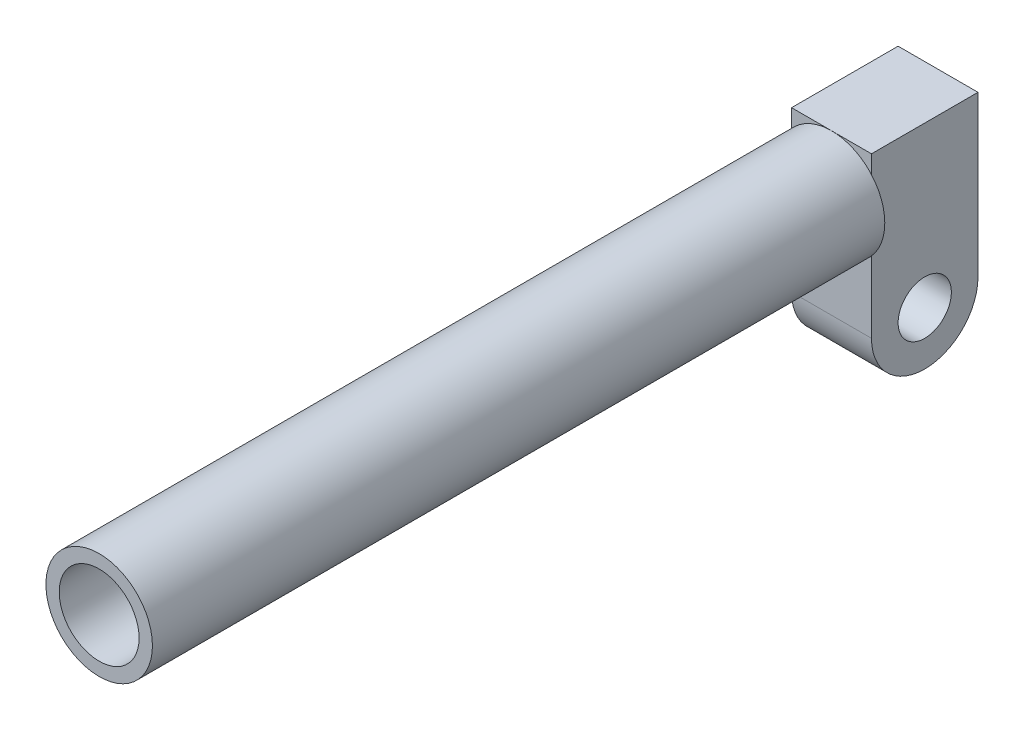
ISO-10303-21;
HEADER;
FILE_DESCRIPTION(('STEP AP214'),'2;1');
FILE_NAME('part.step','',(''),(''),'','','');
FILE_SCHEMA(('AUTOMOTIVE_DESIGN { 1 0 10303 214 1 1 1 1 }'));
ENDSEC;
DATA;
#1=APPLICATION_CONTEXT('core data for automotive mechanical design processes');
#2=APPLICATION_PROTOCOL_DEFINITION('international standard','automotive_design',2000,#1);
#3=PRODUCT_CONTEXT('',#1,'mechanical');
#4=PRODUCT('Part','Part','',(#3));
#5=PRODUCT_RELATED_PRODUCT_CATEGORY('part','',(#4));
#6=PRODUCT_DEFINITION_FORMATION('','',#4);
#7=PRODUCT_DEFINITION_CONTEXT('part definition',#1,'design');
#8=PRODUCT_DEFINITION('design','',#6,#7);
#9=PRODUCT_DEFINITION_SHAPE('','',#8);
#10=(LENGTH_UNIT() NAMED_UNIT(*) SI_UNIT(.MILLI.,.METRE.));
#11=(NAMED_UNIT(*) PLANE_ANGLE_UNIT() SI_UNIT($,.RADIAN.));
#12=(NAMED_UNIT(*) SI_UNIT($,.STERADIAN.) SOLID_ANGLE_UNIT());
#13=UNCERTAINTY_MEASURE_WITH_UNIT(LENGTH_MEASURE(1.E-05),#10,'distance_accuracy_value','');
#14=(GEOMETRIC_REPRESENTATION_CONTEXT(3) GLOBAL_UNCERTAINTY_ASSIGNED_CONTEXT((#13)) GLOBAL_UNIT_ASSIGNED_CONTEXT((#10,
#11,#12)) REPRESENTATION_CONTEXT('',''));
#15=CARTESIAN_POINT('',(0.,0.,0.));
#16=DIRECTION('',(0.,0.,1.));
#17=DIRECTION('',(1.,0.,0.));
#18=AXIS2_PLACEMENT_3D('',#15,#16,#17);
#19=CARTESIAN_POINT('',(0.,80.,590.));
#20=DIRECTION('',(0.,0.,1.));
#21=DIRECTION('',(1.,0.,0.));
#22=AXIS2_PLACEMENT_3D('',#19,#20,#21);
#23=PLANE('',#22);
#24=CARTESIAN_POINT('',(0.,80.,590.));
#25=DIRECTION('',(0.,0.,1.));
#26=DIRECTION('',(1.,0.,0.));
#27=AXIS2_PLACEMENT_3D('',#24,#25,#26);
#28=CIRCLE('',#27,40.);
#29=CARTESIAN_POINT('',(40.,80.,590.));
#30=VERTEX_POINT('',#29);
#31=EDGE_CURVE('E11',#30,#30,#28,.T.);
#32=ORIENTED_EDGE('',*,*,#31,.T.);
#33=EDGE_LOOP('',(#32));
#34=FACE_BOUND('',#33,.T.);
#35=CARTESIAN_POINT('',(0.,80.,590.));
#36=DIRECTION('',(0.,0.,1.));
#37=DIRECTION('',(1.,0.,0.));
#38=AXIS2_PLACEMENT_3D('',#35,#36,#37);
#39=CIRCLE('',#38,30.);
#40=CARTESIAN_POINT('',(30.,80.,590.));
#41=VERTEX_POINT('',#40);
#42=EDGE_CURVE('E60',#41,#41,#39,.T.);
#43=ORIENTED_EDGE('',*,*,#42,.F.);
#44=EDGE_LOOP('',(#43));
#45=FACE_BOUND('',#44,.T.);
#46=ADVANCED_FACE('F49',(#34,#45),#23,.T.);
#47=CARTESIAN_POINT('',(0.,80.,40.));
#48=DIRECTION('',(0.,0.,1.));
#49=DIRECTION('',(1.,0.,0.));
#50=AXIS2_PLACEMENT_3D('',#47,#48,#49);
#51=PLANE('',#50);
#52=CARTESIAN_POINT('',(0.,80.,40.));
#53=DIRECTION('',(0.,0.,1.));
#54=DIRECTION('',(1.,0.,0.));
#55=AXIS2_PLACEMENT_3D('',#52,#53,#54);
#56=CIRCLE('',#55,40.);
#57=CARTESIAN_POINT('',(40.,80.,40.));
#58=VERTEX_POINT('',#57);
#59=EDGE_CURVE('E53',#58,#58,#56,.T.);
#60=ORIENTED_EDGE('',*,*,#59,.F.);
#61=EDGE_LOOP('',(#60));
#62=FACE_BOUND('',#61,.T.);
#63=CARTESIAN_POINT('',(0.,80.,40.));
#64=DIRECTION('',(0.,0.,1.));
#65=DIRECTION('',(1.,0.,0.));
#66=AXIS2_PLACEMENT_3D('',#63,#64,#65);
#67=CIRCLE('',#66,30.);
#68=CARTESIAN_POINT('',(30.,80.,40.));
#69=VERTEX_POINT('',#68);
#70=EDGE_CURVE('E62',#69,#69,#67,.T.);
#71=ORIENTED_EDGE('',*,*,#70,.T.);
#72=EDGE_LOOP('',(#71));
#73=FACE_BOUND('',#72,.T.);
#74=ADVANCED_FACE('F72',(#62,#73),#51,.F.);
#75=CARTESIAN_POINT('',(0.,80.,590.));
#76=DIRECTION('',(0.,0.,-1.));
#77=DIRECTION('',(-1.,0.,0.));
#78=AXIS2_PLACEMENT_3D('',#75,#76,#77);
#79=CYLINDRICAL_SURFACE('',#78,40.);
#80=ORIENTED_EDGE('',*,*,#31,.F.);
#81=EDGE_LOOP('',(#80));
#82=FACE_BOUND('',#81,.T.);
#83=ORIENTED_EDGE('',*,*,#59,.T.);
#84=EDGE_LOOP('',(#83));
#85=FACE_BOUND('',#84,.T.);
#86=ADVANCED_FACE('F51',(#82,#85),#79,.T.);
#87=CARTESIAN_POINT('',(0.,80.,590.));
#88=DIRECTION('',(0.,0.,-1.));
#89=DIRECTION('',(-1.,0.,0.));
#90=AXIS2_PLACEMENT_3D('',#87,#88,#89);
#91=CYLINDRICAL_SURFACE('',#90,30.);
#92=ORIENTED_EDGE('',*,*,#42,.T.);
#93=EDGE_LOOP('',(#92));
#94=FACE_BOUND('',#93,.T.);
#95=ORIENTED_EDGE('',*,*,#70,.F.);
#96=EDGE_LOOP('',(#95));
#97=FACE_BOUND('',#96,.T.);
#98=ADVANCED_FACE('F68',(#94,#97),#91,.F.);
#99=CLOSED_SHELL('',(#46,#74,#86,#98));
#100=MANIFOLD_SOLID_BREP('B2',#99);
#101=CARTESIAN_POINT('',(30.,0.,40.));
#102=DIRECTION('',(0.,0.,1.));
#103=DIRECTION('',(0.,-1.,0.));
#104=AXIS2_PLACEMENT_3D('',#101,#102,#103);
#105=PLANE('',#104);
#106=DIRECTION('',(0.,1.,0.));
#107=VECTOR('',#106,1.);
#108=CARTESIAN_POINT('',(-30.,0.,40.));
#109=LINE('',#108,#107);
#110=CARTESIAN_POINT('',(-30.,0.,40.));
#111=VERTEX_POINT('',#110);
#112=CARTESIAN_POINT('',(-30.,120.,40.));
#113=VERTEX_POINT('',#112);
#114=EDGE_CURVE('E186',#111,#113,#109,.T.);
#115=ORIENTED_EDGE('',*,*,#114,.F.);
#116=DIRECTION('',(-1.,0.,0.));
#117=VECTOR('',#116,1.);
#118=CARTESIAN_POINT('',(30.,0.,40.));
#119=LINE('',#118,#117);
#120=CARTESIAN_POINT('',(30.,0.,40.));
#121=VERTEX_POINT('',#120);
#122=EDGE_CURVE('E47',#121,#111,#119,.T.);
#123=ORIENTED_EDGE('',*,*,#122,.F.);
#124=DIRECTION('',(0.,1.,0.));
#125=VECTOR('',#124,1.);
#126=CARTESIAN_POINT('',(30.,0.,40.));
#127=LINE('',#126,#125);
#128=CARTESIAN_POINT('',(30.,120.,40.));
#129=VERTEX_POINT('',#128);
#130=EDGE_CURVE('E168',#121,#129,#127,.T.);
#131=ORIENTED_EDGE('',*,*,#130,.T.);
#132=DIRECTION('',(-1.,0.,0.));
#133=VECTOR('',#132,1.);
#134=CARTESIAN_POINT('',(30.,120.,40.));
#135=LINE('',#134,#133);
#136=EDGE_CURVE('E135',#129,#113,#135,.T.);
#137=ORIENTED_EDGE('',*,*,#136,.T.);
#138=EDGE_LOOP('',(#115,#123,#131,#137));
#139=FACE_BOUND('',#138,.T.);
#140=ADVANCED_FACE('F119',(#139),#105,.T.);
#141=CARTESIAN_POINT('',(30.,0.,0.));
#142=DIRECTION('',(-1.,0.,0.));
#143=DIRECTION('',(0.,0.,1.));
#144=AXIS2_PLACEMENT_3D('',#141,#142,#143);
#145=CYLINDRICAL_SURFACE('',#144,40.);
#146=CARTESIAN_POINT('',(-30.,0.,0.));
#147=DIRECTION('',(1.,0.,0.));
#148=DIRECTION('',(0.,0.,-1.));
#149=AXIS2_PLACEMENT_3D('',#146,#147,#148);
#150=CIRCLE('',#149,40.);
#151=CARTESIAN_POINT('',(-30.,0.,-40.));
#152=VERTEX_POINT('',#151);
#153=EDGE_CURVE('E174',#111,#152,#150,.T.);
#154=ORIENTED_EDGE('',*,*,#153,.T.);
#155=DIRECTION('',(-1.,0.,0.));
#156=VECTOR('',#155,1.);
#157=CARTESIAN_POINT('',(30.,0.,-40.));
#158=LINE('',#157,#156);
#159=CARTESIAN_POINT('',(30.,0.,-40.));
#160=VERTEX_POINT('',#159);
#161=EDGE_CURVE('E127',#160,#152,#158,.T.);
#162=ORIENTED_EDGE('',*,*,#161,.F.);
#163=CARTESIAN_POINT('',(30.,0.,0.));
#164=DIRECTION('',(1.,0.,0.));
#165=DIRECTION('',(0.,0.,-1.));
#166=AXIS2_PLACEMENT_3D('',#163,#164,#165);
#167=CIRCLE('',#166,40.);
#168=EDGE_CURVE('E161',#121,#160,#167,.T.);
#169=ORIENTED_EDGE('',*,*,#168,.F.);
#170=ORIENTED_EDGE('',*,*,#122,.T.);
#171=EDGE_LOOP('',(#154,#162,#169,#170));
#172=FACE_BOUND('',#171,.T.);
#173=ADVANCED_FACE('F172',(#172),#145,.T.);
#174=CARTESIAN_POINT('',(30.,0.,-40.));
#175=DIRECTION('',(0.,0.,-1.));
#176=DIRECTION('',(0.,1.,0.));
#177=AXIS2_PLACEMENT_3D('',#174,#175,#176);
#178=PLANE('',#177);
#179=DIRECTION('',(0.,-1.,0.));
#180=VECTOR('',#179,1.);
#181=CARTESIAN_POINT('',(-30.,0.,-40.));
#182=LINE('',#181,#180);
#183=CARTESIAN_POINT('',(-30.,120.,-40.));
#184=VERTEX_POINT('',#183);
#185=EDGE_CURVE('E189',#184,#152,#182,.T.);
#186=ORIENTED_EDGE('',*,*,#185,.F.);
#187=DIRECTION('',(-1.,0.,0.));
#188=VECTOR('',#187,1.);
#189=CARTESIAN_POINT('',(30.,120.,-40.));
#190=LINE('',#189,#188);
#191=CARTESIAN_POINT('',(30.,120.,-40.));
#192=VERTEX_POINT('',#191);
#193=EDGE_CURVE('E148',#192,#184,#190,.T.);
#194=ORIENTED_EDGE('',*,*,#193,.F.);
#195=DIRECTION('',(0.,-1.,0.));
#196=VECTOR('',#195,1.);
#197=CARTESIAN_POINT('',(30.,0.,-40.));
#198=LINE('',#197,#196);
#199=EDGE_CURVE('E167',#192,#160,#198,.T.);
#200=ORIENTED_EDGE('',*,*,#199,.T.);
#201=ORIENTED_EDGE('',*,*,#161,.T.);
#202=EDGE_LOOP('',(#186,#194,#200,#201));
#203=FACE_BOUND('',#202,.T.);
#204=ADVANCED_FACE('F177',(#203),#178,.T.);
#205=CARTESIAN_POINT('',(30.,120.,0.));
#206=DIRECTION('',(0.,1.,0.));
#207=DIRECTION('',(0.,0.,1.));
#208=AXIS2_PLACEMENT_3D('',#205,#206,#207);
#209=PLANE('',#208);
#210=DIRECTION('',(0.,0.,-1.));
#211=VECTOR('',#210,1.);
#212=CARTESIAN_POINT('',(-30.,120.,0.));
#213=LINE('',#212,#211);
#214=EDGE_CURVE('E191',#113,#184,#213,.T.);
#215=ORIENTED_EDGE('',*,*,#214,.F.);
#216=ORIENTED_EDGE('',*,*,#136,.F.);
#217=DIRECTION('',(0.,0.,-1.));
#218=VECTOR('',#217,1.);
#219=CARTESIAN_POINT('',(30.,120.,0.));
#220=LINE('',#219,#218);
#221=EDGE_CURVE('E178',#129,#192,#220,.T.);
#222=ORIENTED_EDGE('',*,*,#221,.T.);
#223=ORIENTED_EDGE('',*,*,#193,.T.);
#224=EDGE_LOOP('',(#215,#216,#222,#223));
#225=FACE_BOUND('',#224,.T.);
#226=ADVANCED_FACE('F200',(#225),#209,.T.);
#227=CARTESIAN_POINT('',(30.,0.,0.));
#228=DIRECTION('',(-1.,0.,0.));
#229=DIRECTION('',(0.,0.,1.));
#230=AXIS2_PLACEMENT_3D('',#227,#228,#229);
#231=CYLINDRICAL_SURFACE('',#230,20.);
#232=CARTESIAN_POINT('',(30.,0.,0.));
#233=DIRECTION('',(1.,0.,0.));
#234=DIRECTION('',(0.,0.,-1.));
#235=AXIS2_PLACEMENT_3D('',#232,#233,#234);
#236=CIRCLE('',#235,20.);
#237=CARTESIAN_POINT('',(30.,0.,-20.));
#238=VERTEX_POINT('',#237);
#239=EDGE_CURVE('E180',#238,#238,#236,.T.);
#240=ORIENTED_EDGE('',*,*,#239,.T.);
#241=EDGE_LOOP('',(#240));
#242=FACE_BOUND('',#241,.T.);
#243=CARTESIAN_POINT('',(-30.,0.,0.));
#244=DIRECTION('',(1.,0.,0.));
#245=DIRECTION('',(0.,0.,-1.));
#246=AXIS2_PLACEMENT_3D('',#243,#244,#245);
#247=CIRCLE('',#246,20.);
#248=CARTESIAN_POINT('',(-30.,0.,-20.));
#249=VERTEX_POINT('',#248);
#250=EDGE_CURVE('E194',#249,#249,#247,.T.);
#251=ORIENTED_EDGE('',*,*,#250,.F.);
#252=EDGE_LOOP('',(#251));
#253=FACE_BOUND('',#252,.T.);
#254=ADVANCED_FACE('F202',(#242,#253),#231,.F.);
#255=CARTESIAN_POINT('',(30.,0.,0.));
#256=DIRECTION('',(1.,0.,0.));
#257=DIRECTION('',(0.,0.,-1.));
#258=AXIS2_PLACEMENT_3D('',#255,#256,#257);
#259=PLANE('',#258);
#260=ORIENTED_EDGE('',*,*,#130,.F.);
#261=ORIENTED_EDGE('',*,*,#168,.T.);
#262=ORIENTED_EDGE('',*,*,#199,.F.);
#263=ORIENTED_EDGE('',*,*,#221,.F.);
#264=EDGE_LOOP('',(#260,#261,#262,#263));
#265=FACE_BOUND('',#264,.T.);
#266=ORIENTED_EDGE('',*,*,#239,.F.);
#267=EDGE_LOOP('',(#266));
#268=FACE_BOUND('',#267,.T.);
#269=ADVANCED_FACE('F163',(#265,#268),#259,.T.);
#270=CARTESIAN_POINT('',(-30.,0.,0.));
#271=DIRECTION('',(1.,0.,0.));
#272=DIRECTION('',(0.,0.,-1.));
#273=AXIS2_PLACEMENT_3D('',#270,#271,#272);
#274=PLANE('',#273);
#275=ORIENTED_EDGE('',*,*,#114,.T.);
#276=ORIENTED_EDGE('',*,*,#214,.T.);
#277=ORIENTED_EDGE('',*,*,#185,.T.);
#278=ORIENTED_EDGE('',*,*,#153,.F.);
#279=EDGE_LOOP('',(#275,#276,#277,#278));
#280=FACE_BOUND('',#279,.T.);
#281=ORIENTED_EDGE('',*,*,#250,.T.);
#282=EDGE_LOOP('',(#281));
#283=FACE_BOUND('',#282,.T.);
#284=ADVANCED_FACE('F244',(#280,#283),#274,.F.);
#285=CLOSED_SHELL('',(#140,#173,#204,#226,#254,#269,#284));
#286=MANIFOLD_SOLID_BREP('B6',#285);
#287=ADVANCED_BREP_SHAPE_REPRESENTATION('',(#18,#100,#286),#14);
#288=SHAPE_DEFINITION_REPRESENTATION(#9,#287);
ENDSEC;
END-ISO-10303-21;
